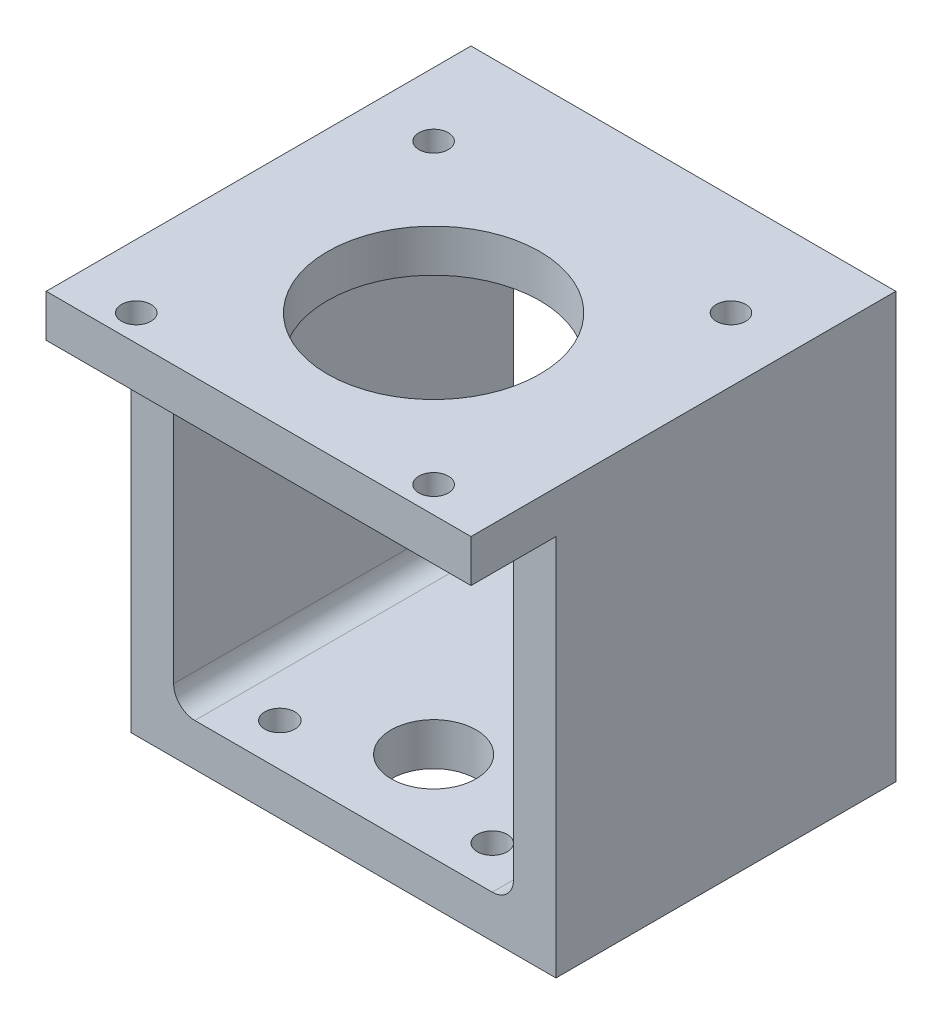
ISO-10303-21;
HEADER;
FILE_DESCRIPTION(('STEP AP214'),'2;1');
FILE_NAME('part.step','',(''),(''),'','','');
FILE_SCHEMA(('AUTOMOTIVE_DESIGN { 1 0 10303 214 1 1 1 1 }'));
ENDSEC;
DATA;
#1=APPLICATION_CONTEXT('core data for automotive mechanical design processes');
#2=APPLICATION_PROTOCOL_DEFINITION('international standard','automotive_design',2000,#1);
#3=PRODUCT_CONTEXT('',#1,'mechanical');
#4=PRODUCT('Part','Part','',(#3));
#5=PRODUCT_RELATED_PRODUCT_CATEGORY('part','',(#4));
#6=PRODUCT_DEFINITION_FORMATION('','',#4);
#7=PRODUCT_DEFINITION_CONTEXT('part definition',#1,'design');
#8=PRODUCT_DEFINITION('design','',#6,#7);
#9=PRODUCT_DEFINITION_SHAPE('','',#8);
#10=(LENGTH_UNIT() NAMED_UNIT(*) SI_UNIT(.MILLI.,.METRE.));
#11=(NAMED_UNIT(*) PLANE_ANGLE_UNIT() SI_UNIT($,.RADIAN.));
#12=(NAMED_UNIT(*) SI_UNIT($,.STERADIAN.) SOLID_ANGLE_UNIT());
#13=UNCERTAINTY_MEASURE_WITH_UNIT(LENGTH_MEASURE(1.E-05),#10,'distance_accuracy_value','');
#14=(GEOMETRIC_REPRESENTATION_CONTEXT(3) GLOBAL_UNCERTAINTY_ASSIGNED_CONTEXT((#13)) GLOBAL_UNIT_ASSIGNED_CONTEXT((#10,
#11,#12)) REPRESENTATION_CONTEXT('',''));
#15=CARTESIAN_POINT('',(0.,0.,0.));
#16=DIRECTION('',(0.,0.,1.));
#17=DIRECTION('',(1.,0.,0.));
#18=AXIS2_PLACEMENT_3D('',#15,#16,#17);
#19=CARTESIAN_POINT('',(0.,0.,-63.5));
#20=DIRECTION('',(-1.,0.,0.));
#21=DIRECTION('',(0.,0.,1.));
#22=AXIS2_PLACEMENT_3D('',#19,#20,#21);
#23=PLANE('',#22);
#24=DIRECTION('',(0.,0.,1.));
#25=VECTOR('',#24,1.);
#26=CARTESIAN_POINT('',(0.,57.15,0.));
#27=LINE('',#26,#25);
#28=CARTESIAN_POINT('',(0.,57.15,-12.7));
#29=VERTEX_POINT('',#28);
#30=CARTESIAN_POINT('',(0.,57.15,0.));
#31=VERTEX_POINT('',#30);
#32=EDGE_CURVE('E237',#29,#31,#27,.T.);
#33=ORIENTED_EDGE('',*,*,#32,.T.);
#34=DIRECTION('',(0.,-1.,0.));
#35=VECTOR('',#34,1.);
#36=CARTESIAN_POINT('',(0.,0.,0.));
#37=LINE('',#36,#35);
#38=CARTESIAN_POINT('',(0.,63.5,0.));
#39=VERTEX_POINT('',#38);
#40=EDGE_CURVE('E299',#39,#31,#37,.T.);
#41=ORIENTED_EDGE('',*,*,#40,.F.);
#42=DIRECTION('',(0.,0.,1.));
#43=VECTOR('',#42,1.);
#44=CARTESIAN_POINT('',(0.,63.5,-63.5));
#45=LINE('',#44,#43);
#46=CARTESIAN_POINT('',(0.,63.5,-63.5));
#47=VERTEX_POINT('',#46);
#48=EDGE_CURVE('E342',#47,#39,#45,.T.);
#49=ORIENTED_EDGE('',*,*,#48,.F.);
#50=DIRECTION('',(0.,-1.,0.));
#51=VECTOR('',#50,1.);
#52=CARTESIAN_POINT('',(0.,0.,-63.5));
#53=LINE('',#52,#51);
#54=CARTESIAN_POINT('',(0.,0.,-63.5));
#55=VERTEX_POINT('',#54);
#56=EDGE_CURVE('E322',#47,#55,#53,.T.);
#57=ORIENTED_EDGE('',*,*,#56,.T.);
#58=DIRECTION('',(0.,0.,1.));
#59=VECTOR('',#58,1.);
#60=CARTESIAN_POINT('',(0.,0.,-63.5));
#61=LINE('',#60,#59);
#62=CARTESIAN_POINT('',(0.,0.,-12.7));
#63=VERTEX_POINT('',#62);
#64=EDGE_CURVE('E335',#55,#63,#61,.T.);
#65=ORIENTED_EDGE('',*,*,#64,.T.);
#66=DIRECTION('',(0.,1.,0.));
#67=VECTOR('',#66,1.);
#68=CARTESIAN_POINT('',(0.,0.,-12.7));
#69=LINE('',#68,#67);
#70=EDGE_CURVE('E234',#63,#29,#69,.T.);
#71=ORIENTED_EDGE('',*,*,#70,.T.);
#72=EDGE_LOOP('',(#33,#41,#49,#57,#65,#71));
#73=FACE_BOUND('',#72,.T.);
#74=ADVANCED_FACE('F34',(#73),#23,.T.);
#75=CARTESIAN_POINT('',(0.,63.5,-63.5));
#76=DIRECTION('',(0.,1.,0.));
#77=DIRECTION('',(0.,0.,1.));
#78=AXIS2_PLACEMENT_3D('',#75,#76,#77);
#79=PLANE('',#78);
#80=CARTESIAN_POINT('',(9.52499999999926,63.5,-48.387));
#81=DIRECTION('',(0.,1.,0.));
#82=DIRECTION('',(0.,0.,1.));
#83=AXIS2_PLACEMENT_3D('',#80,#81,#82);
#84=CIRCLE('',#83,2.1971);
#85=CARTESIAN_POINT('',(9.52499999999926,63.5,-46.1899));
#86=VERTEX_POINT('',#85);
#87=EDGE_CURVE('E205',#86,#86,#84,.T.);
#88=ORIENTED_EDGE('',*,*,#87,.F.);
#89=EDGE_LOOP('',(#88));
#90=FACE_BOUND('',#89,.T.);
#91=CARTESIAN_POINT('',(9.52499999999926,63.5,-3.93700000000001));
#92=DIRECTION('',(0.,1.,0.));
#93=DIRECTION('',(0.,0.,1.));
#94=AXIS2_PLACEMENT_3D('',#91,#92,#93);
#95=CIRCLE('',#94,2.1971);
#96=CARTESIAN_POINT('',(9.52499999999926,63.5,-1.73990000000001));
#97=VERTEX_POINT('',#96);
#98=EDGE_CURVE('E209',#97,#97,#95,.T.);
#99=ORIENTED_EDGE('',*,*,#98,.F.);
#100=EDGE_LOOP('',(#99));
#101=FACE_BOUND('',#100,.T.);
#102=CARTESIAN_POINT('',(53.9749999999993,63.5,-48.387));
#103=DIRECTION('',(0.,1.,0.));
#104=DIRECTION('',(0.,0.,1.));
#105=AXIS2_PLACEMENT_3D('',#102,#103,#104);
#106=CIRCLE('',#105,2.1971);
#107=CARTESIAN_POINT('',(53.9749999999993,63.5,-46.1899));
#108=VERTEX_POINT('',#107);
#109=EDGE_CURVE('E213',#108,#108,#106,.T.);
#110=ORIENTED_EDGE('',*,*,#109,.F.);
#111=EDGE_LOOP('',(#110));
#112=FACE_BOUND('',#111,.T.);
#113=CARTESIAN_POINT('',(53.9749999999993,63.5,-3.937));
#114=DIRECTION('',(0.,1.,0.));
#115=DIRECTION('',(0.,0.,1.));
#116=AXIS2_PLACEMENT_3D('',#113,#114,#115);
#117=CIRCLE('',#116,2.1971);
#118=CARTESIAN_POINT('',(53.9749999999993,63.5,-1.7399));
#119=VERTEX_POINT('',#118);
#120=EDGE_CURVE('E217',#119,#119,#117,.T.);
#121=ORIENTED_EDGE('',*,*,#120,.F.);
#122=EDGE_LOOP('',(#121));
#123=FACE_BOUND('',#122,.T.);
#124=CARTESIAN_POINT('',(31.7499999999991,63.5,-26.162));
#125=DIRECTION('',(0.,1.,0.));
#126=DIRECTION('',(0.,0.,1.));
#127=AXIS2_PLACEMENT_3D('',#124,#125,#126);
#128=CIRCLE('',#127,15.875);
#129=CARTESIAN_POINT('',(31.7499999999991,63.5,-10.287));
#130=VERTEX_POINT('',#129);
#131=EDGE_CURVE('E227',#130,#130,#128,.T.);
#132=ORIENTED_EDGE('',*,*,#131,.F.);
#133=EDGE_LOOP('',(#132));
#134=FACE_BOUND('',#133,.T.);
#135=DIRECTION('',(-1.,0.,0.));
#136=VECTOR('',#135,1.);
#137=CARTESIAN_POINT('',(0.,63.5,0.));
#138=LINE('',#137,#136);
#139=CARTESIAN_POINT('',(63.5,63.5,0.));
#140=VERTEX_POINT('',#139);
#141=EDGE_CURVE('E326',#140,#39,#138,.T.);
#142=ORIENTED_EDGE('',*,*,#141,.F.);
#143=DIRECTION('',(0.,0.,1.));
#144=VECTOR('',#143,1.);
#145=CARTESIAN_POINT('',(63.5,63.5,-63.5));
#146=LINE('',#145,#144);
#147=CARTESIAN_POINT('',(63.5,63.5,-63.5));
#148=VERTEX_POINT('',#147);
#149=EDGE_CURVE('E345',#148,#140,#146,.T.);
#150=ORIENTED_EDGE('',*,*,#149,.F.);
#151=DIRECTION('',(-1.,0.,0.));
#152=VECTOR('',#151,1.);
#153=CARTESIAN_POINT('',(0.,63.5,-63.5));
#154=LINE('',#153,#152);
#155=EDGE_CURVE('E332',#148,#47,#154,.T.);
#156=ORIENTED_EDGE('',*,*,#155,.T.);
#157=ORIENTED_EDGE('',*,*,#48,.T.);
#158=EDGE_LOOP('',(#142,#150,#156,#157));
#159=FACE_BOUND('',#158,.T.);
#160=ADVANCED_FACE('F407',(#90,#101,#112,#123,#134,#159),#79,.T.);
#161=CARTESIAN_POINT('',(63.5,0.,-63.5));
#162=DIRECTION('',(1.,0.,0.));
#163=DIRECTION('',(0.,0.,-1.));
#164=AXIS2_PLACEMENT_3D('',#161,#162,#163);
#165=PLANE('',#164);
#166=DIRECTION('',(0.,0.,1.));
#167=VECTOR('',#166,1.);
#168=CARTESIAN_POINT('',(63.5,57.15,0.));
#169=LINE('',#168,#167);
#170=CARTESIAN_POINT('',(63.5,57.15,-12.7));
#171=VERTEX_POINT('',#170);
#172=CARTESIAN_POINT('',(63.5,57.15,0.));
#173=VERTEX_POINT('',#172);
#174=EDGE_CURVE('E238',#171,#173,#169,.T.);
#175=ORIENTED_EDGE('',*,*,#174,.F.);
#176=DIRECTION('',(0.,1.,0.));
#177=VECTOR('',#176,1.);
#178=CARTESIAN_POINT('',(63.5,0.,-12.7));
#179=LINE('',#178,#177);
#180=CARTESIAN_POINT('',(63.5,0.,-12.7));
#181=VERTEX_POINT('',#180);
#182=EDGE_CURVE('E233',#181,#171,#179,.T.);
#183=ORIENTED_EDGE('',*,*,#182,.F.);
#184=DIRECTION('',(0.,0.,1.));
#185=VECTOR('',#184,1.);
#186=CARTESIAN_POINT('',(63.5,0.,-63.5));
#187=LINE('',#186,#185);
#188=CARTESIAN_POINT('',(63.5,0.,-63.5));
#189=VERTEX_POINT('',#188);
#190=EDGE_CURVE('E348',#189,#181,#187,.T.);
#191=ORIENTED_EDGE('',*,*,#190,.F.);
#192=DIRECTION('',(0.,1.,0.));
#193=VECTOR('',#192,1.);
#194=CARTESIAN_POINT('',(63.5,0.,-63.5));
#195=LINE('',#194,#193);
#196=EDGE_CURVE('E329',#189,#148,#195,.T.);
#197=ORIENTED_EDGE('',*,*,#196,.T.);
#198=ORIENTED_EDGE('',*,*,#149,.T.);
#199=DIRECTION('',(0.,1.,0.));
#200=VECTOR('',#199,1.);
#201=CARTESIAN_POINT('',(63.5,0.,0.));
#202=LINE('',#201,#200);
#203=EDGE_CURVE('E338',#173,#140,#202,.T.);
#204=ORIENTED_EDGE('',*,*,#203,.F.);
#205=EDGE_LOOP('',(#175,#183,#191,#197,#198,#204));
#206=FACE_BOUND('',#205,.T.);
#207=ADVANCED_FACE('F412',(#206),#165,.T.);
#208=CARTESIAN_POINT('',(0.,0.,-63.5));
#209=DIRECTION('',(0.,-1.,0.));
#210=DIRECTION('',(0.,0.,-1.));
#211=AXIS2_PLACEMENT_3D('',#208,#209,#210);
#212=PLANE('',#211);
#213=CARTESIAN_POINT('',(15.875,0.,-19.05));
#214=DIRECTION('',(0.,-1.,0.));
#215=DIRECTION('',(0.,0.,-1.));
#216=AXIS2_PLACEMENT_3D('',#213,#214,#215);
#217=CIRCLE('',#216,2.24789999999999);
#218=CARTESIAN_POINT('',(15.875,0.,-21.2979));
#219=VERTEX_POINT('',#218);
#220=EDGE_CURVE('E190',#219,#219,#217,.T.);
#221=ORIENTED_EDGE('',*,*,#220,.F.);
#222=EDGE_LOOP('',(#221));
#223=FACE_BOUND('',#222,.T.);
#224=CARTESIAN_POINT('',(15.875,0.,-57.15));
#225=DIRECTION('',(0.,-1.,0.));
#226=DIRECTION('',(0.,0.,-1.));
#227=AXIS2_PLACEMENT_3D('',#224,#225,#226);
#228=CIRCLE('',#227,2.24789999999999);
#229=CARTESIAN_POINT('',(15.875,0.,-59.3979));
#230=VERTEX_POINT('',#229);
#231=EDGE_CURVE('E193',#230,#230,#228,.T.);
#232=ORIENTED_EDGE('',*,*,#231,.F.);
#233=EDGE_LOOP('',(#232));
#234=FACE_BOUND('',#233,.T.);
#235=CARTESIAN_POINT('',(47.625,0.,-57.15));
#236=DIRECTION('',(0.,-1.,0.));
#237=DIRECTION('',(0.,0.,-1.));
#238=AXIS2_PLACEMENT_3D('',#235,#236,#237);
#239=CIRCLE('',#238,2.24789999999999);
#240=CARTESIAN_POINT('',(47.625,0.,-59.3979));
#241=VERTEX_POINT('',#240);
#242=EDGE_CURVE('E197',#241,#241,#239,.T.);
#243=ORIENTED_EDGE('',*,*,#242,.F.);
#244=EDGE_LOOP('',(#243));
#245=FACE_BOUND('',#244,.T.);
#246=CARTESIAN_POINT('',(47.625,0.,-19.05));
#247=DIRECTION('',(0.,-1.,0.));
#248=DIRECTION('',(0.,0.,-1.));
#249=AXIS2_PLACEMENT_3D('',#246,#247,#248);
#250=CIRCLE('',#249,2.24789999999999);
#251=CARTESIAN_POINT('',(47.625,0.,-21.2979));
#252=VERTEX_POINT('',#251);
#253=EDGE_CURVE('E201',#252,#252,#250,.T.);
#254=ORIENTED_EDGE('',*,*,#253,.F.);
#255=EDGE_LOOP('',(#254));
#256=FACE_BOUND('',#255,.T.);
#257=CARTESIAN_POINT('',(31.7499999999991,0.,-26.162));
#258=DIRECTION('',(0.,-1.,0.));
#259=DIRECTION('',(0.,0.,-1.));
#260=AXIS2_PLACEMENT_3D('',#257,#258,#259);
#261=CIRCLE('',#260,6.35);
#262=CARTESIAN_POINT('',(31.7499999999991,0.,-32.512));
#263=VERTEX_POINT('',#262);
#264=EDGE_CURVE('E224',#263,#263,#261,.F.);
#265=ORIENTED_EDGE('',*,*,#264,.T.);
#266=EDGE_LOOP('',(#265));
#267=FACE_BOUND('',#266,.T.);
#268=DIRECTION('',(1.,0.,0.));
#269=VECTOR('',#268,1.);
#270=CARTESIAN_POINT('',(0.,0.,-12.7));
#271=LINE('',#270,#269);
#272=EDGE_CURVE('E241',#63,#181,#271,.T.);
#273=ORIENTED_EDGE('',*,*,#272,.F.);
#274=ORIENTED_EDGE('',*,*,#64,.F.);
#275=DIRECTION('',(1.,0.,0.));
#276=VECTOR('',#275,1.);
#277=CARTESIAN_POINT('',(0.,0.,-63.5));
#278=LINE('',#277,#276);
#279=EDGE_CURVE('E325',#55,#189,#278,.T.);
#280=ORIENTED_EDGE('',*,*,#279,.T.);
#281=ORIENTED_EDGE('',*,*,#190,.T.);
#282=EDGE_LOOP('',(#273,#274,#280,#281));
#283=FACE_BOUND('',#282,.T.);
#284=ADVANCED_FACE('F430',(#223,#234,#245,#256,#267,#283),#212,.T.);
#285=CARTESIAN_POINT('',(0.,63.5,-63.5));
#286=DIRECTION('',(0.,0.,-1.));
#287=DIRECTION('',(-1.,0.,0.));
#288=AXIS2_PLACEMENT_3D('',#285,#286,#287);
#289=PLANE('',#288);
#290=CARTESIAN_POINT('',(60.325,60.325,-63.5));
#291=DIRECTION('',(0.,0.,-1.));
#292=DIRECTION('',(-1.,0.,0.));
#293=AXIS2_PLACEMENT_3D('',#290,#291,#292);
#294=CIRCLE('',#293,1.52399999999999);
#295=CARTESIAN_POINT('',(58.801,60.325,-63.5));
#296=VERTEX_POINT('',#295);
#297=EDGE_CURVE('E168',#296,#296,#294,.T.);
#298=ORIENTED_EDGE('',*,*,#297,.F.);
#299=EDGE_LOOP('',(#298));
#300=FACE_BOUND('',#299,.T.);
#301=CARTESIAN_POINT('',(3.175,60.325,-63.5));
#302=DIRECTION('',(0.,0.,-1.));
#303=DIRECTION('',(-1.,0.,0.));
#304=AXIS2_PLACEMENT_3D('',#301,#302,#303);
#305=CIRCLE('',#304,1.52399999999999);
#306=CARTESIAN_POINT('',(1.65100000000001,60.325,-63.5));
#307=VERTEX_POINT('',#306);
#308=EDGE_CURVE('E167',#307,#307,#305,.T.);
#309=ORIENTED_EDGE('',*,*,#308,.F.);
#310=EDGE_LOOP('',(#309));
#311=FACE_BOUND('',#310,.T.);
#312=CARTESIAN_POINT('',(3.175,3.175,-63.5));
#313=DIRECTION('',(0.,0.,-1.));
#314=DIRECTION('',(-1.,0.,0.));
#315=AXIS2_PLACEMENT_3D('',#312,#313,#314);
#316=CIRCLE('',#315,1.52399999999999);
#317=CARTESIAN_POINT('',(1.65100000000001,3.175,-63.5));
#318=VERTEX_POINT('',#317);
#319=EDGE_CURVE('E178',#318,#318,#316,.T.);
#320=ORIENTED_EDGE('',*,*,#319,.F.);
#321=EDGE_LOOP('',(#320));
#322=FACE_BOUND('',#321,.T.);
#323=CARTESIAN_POINT('',(60.325,3.17500000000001,-63.5));
#324=DIRECTION('',(0.,0.,-1.));
#325=DIRECTION('',(-1.,0.,0.));
#326=AXIS2_PLACEMENT_3D('',#323,#324,#325);
#327=CIRCLE('',#326,1.52399999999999);
#328=CARTESIAN_POINT('',(58.801,3.17500000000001,-63.5));
#329=VERTEX_POINT('',#328);
#330=EDGE_CURVE('E184',#329,#329,#327,.T.);
#331=ORIENTED_EDGE('',*,*,#330,.F.);
#332=EDGE_LOOP('',(#331));
#333=FACE_BOUND('',#332,.T.);
#334=CARTESIAN_POINT('',(9.525,53.975,-63.5));
#335=DIRECTION('',(0.,0.,1.));
#336=DIRECTION('',(1.,0.,0.));
#337=AXIS2_PLACEMENT_3D('',#334,#335,#336);
#338=CIRCLE('',#337,3.175);
#339=CARTESIAN_POINT('',(9.525,57.15,-63.5));
#340=VERTEX_POINT('',#339);
#341=CARTESIAN_POINT('',(6.35,53.975,-63.5));
#342=VERTEX_POINT('',#341);
#343=EDGE_CURVE('E270',#340,#342,#338,.T.);
#344=ORIENTED_EDGE('',*,*,#343,.T.);
#345=DIRECTION('',(0.,-1.,0.));
#346=VECTOR('',#345,1.);
#347=CARTESIAN_POINT('',(6.35,53.975,-63.5));
#348=LINE('',#347,#346);
#349=CARTESIAN_POINT('',(6.35,9.52500000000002,-63.5));
#350=VERTEX_POINT('',#349);
#351=EDGE_CURVE('E273',#342,#350,#348,.T.);
#352=ORIENTED_EDGE('',*,*,#351,.T.);
#353=CARTESIAN_POINT('',(9.525,9.525,-63.5));
#354=DIRECTION('',(0.,0.,1.));
#355=DIRECTION('',(1.,0.,0.));
#356=AXIS2_PLACEMENT_3D('',#353,#354,#355);
#357=CIRCLE('',#356,3.175);
#358=CARTESIAN_POINT('',(9.52500000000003,6.35,-63.5));
#359=VERTEX_POINT('',#358);
#360=EDGE_CURVE('E276',#350,#359,#357,.T.);
#361=ORIENTED_EDGE('',*,*,#360,.T.);
#362=DIRECTION('',(1.,0.,0.));
#363=VECTOR('',#362,1.);
#364=CARTESIAN_POINT('',(9.52500000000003,6.35,-63.5));
#365=LINE('',#364,#363);
#366=CARTESIAN_POINT('',(53.975,6.35,-63.5));
#367=VERTEX_POINT('',#366);
#368=EDGE_CURVE('E279',#359,#367,#365,.T.);
#369=ORIENTED_EDGE('',*,*,#368,.T.);
#370=CARTESIAN_POINT('',(53.975,9.525,-63.5));
#371=DIRECTION('',(0.,0.,1.));
#372=DIRECTION('',(1.,0.,0.));
#373=AXIS2_PLACEMENT_3D('',#370,#371,#372);
#374=CIRCLE('',#373,3.175);
#375=CARTESIAN_POINT('',(57.15,9.525,-63.5));
#376=VERTEX_POINT('',#375);
#377=EDGE_CURVE('E282',#367,#376,#374,.T.);
#378=ORIENTED_EDGE('',*,*,#377,.T.);
#379=DIRECTION('',(0.,1.,0.));
#380=VECTOR('',#379,1.);
#381=CARTESIAN_POINT('',(57.15,53.975,-63.5));
#382=LINE('',#381,#380);
#383=CARTESIAN_POINT('',(57.15,53.975,-63.5));
#384=VERTEX_POINT('',#383);
#385=EDGE_CURVE('E285',#376,#384,#382,.T.);
#386=ORIENTED_EDGE('',*,*,#385,.T.);
#387=CARTESIAN_POINT('',(53.975,53.975,-63.5));
#388=DIRECTION('',(0.,0.,1.));
#389=DIRECTION('',(-1.,0.,0.));
#390=AXIS2_PLACEMENT_3D('',#387,#388,#389);
#391=CIRCLE('',#390,3.175);
#392=CARTESIAN_POINT('',(53.975,57.15,-63.5));
#393=VERTEX_POINT('',#392);
#394=EDGE_CURVE('E288',#384,#393,#391,.T.);
#395=ORIENTED_EDGE('',*,*,#394,.T.);
#396=DIRECTION('',(-1.,0.,0.));
#397=VECTOR('',#396,1.);
#398=CARTESIAN_POINT('',(9.525,57.15,-63.5));
#399=LINE('',#398,#397);
#400=EDGE_CURVE('E291',#393,#340,#399,.T.);
#401=ORIENTED_EDGE('',*,*,#400,.T.);
#402=EDGE_LOOP('',(#344,#352,#361,#369,#378,#386,#395,#401));
#403=FACE_BOUND('',#402,.T.);
#404=ORIENTED_EDGE('',*,*,#56,.F.);
#405=ORIENTED_EDGE('',*,*,#155,.F.);
#406=ORIENTED_EDGE('',*,*,#196,.F.);
#407=ORIENTED_EDGE('',*,*,#279,.F.);
#408=EDGE_LOOP('',(#404,#405,#406,#407));
#409=FACE_BOUND('',#408,.T.);
#410=ADVANCED_FACE('F426',(#300,#311,#322,#333,#403,#409),#289,.T.);
#411=CARTESIAN_POINT('',(0.,63.5,0.));
#412=DIRECTION('',(0.,0.,-1.));
#413=DIRECTION('',(-1.,0.,0.));
#414=AXIS2_PLACEMENT_3D('',#411,#412,#413);
#415=PLANE('',#414);
#416=ORIENTED_EDGE('',*,*,#40,.T.);
#417=DIRECTION('',(-1.,0.,0.));
#418=VECTOR('',#417,1.);
#419=CARTESIAN_POINT('',(9.525,57.15,0.));
#420=LINE('',#419,#418);
#421=EDGE_CURVE('E269',#173,#31,#420,.T.);
#422=ORIENTED_EDGE('',*,*,#421,.F.);
#423=ORIENTED_EDGE('',*,*,#203,.T.);
#424=ORIENTED_EDGE('',*,*,#141,.T.);
#425=EDGE_LOOP('',(#416,#422,#423,#424));
#426=FACE_BOUND('',#425,.T.);
#427=ADVANCED_FACE('F401',(#426),#415,.F.);
#428=CARTESIAN_POINT('',(9.525,53.975,-63.5));
#429=DIRECTION('',(0.,0.,1.));
#430=DIRECTION('',(1.,0.,0.));
#431=AXIS2_PLACEMENT_3D('',#428,#429,#430);
#432=CYLINDRICAL_SURFACE('',#431,3.175);
#433=DIRECTION('',(0.,0.,1.));
#434=VECTOR('',#433,1.);
#435=CARTESIAN_POINT('',(9.525,57.15,-63.5));
#436=LINE('',#435,#434);
#437=CARTESIAN_POINT('',(9.525,57.15,-50.5841));
#438=VERTEX_POINT('',#437);
#439=EDGE_CURVE('E296',#340,#438,#436,.T.);
#440=ORIENTED_EDGE('',*,*,#439,.T.);
#441=CARTESIAN_POINT('',(9.525,57.15,-50.5841));
#442=CARTESIAN_POINT('',(9.47002958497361,57.1500119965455,-50.5841110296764));
#443=CARTESIAN_POINT('',(9.41506752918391,57.1485727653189,-50.5820373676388));
#444=CARTESIAN_POINT('',(9.30562816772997,57.1428828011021,-50.5738061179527));
#445=CARTESIAN_POINT('',(9.25115059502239,57.1386337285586,-50.5676509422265));
#446=CARTESIAN_POINT('',(9.14342311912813,57.127450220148,-50.5513933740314));
#447=CARTESIAN_POINT('',(9.09016763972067,57.1205328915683,-50.5413161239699));
#448=CARTESIAN_POINT('',(8.98492079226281,57.1041820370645,-50.5173706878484));
#449=CARTESIAN_POINT('',(8.93292955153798,57.0947482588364,-50.5035021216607));
#450=CARTESIAN_POINT('',(8.77958333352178,57.0630129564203,-50.4565383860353));
#451=CARTESIAN_POINT('',(8.68053740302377,57.0372426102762,-50.4180357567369));
#452=CARTESIAN_POINT('',(8.49071449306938,56.978464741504,-50.328280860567));
#453=CARTESIAN_POINT('',(8.39994866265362,56.9454476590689,-50.2770117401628));
#454=CARTESIAN_POINT('',(8.22038064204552,56.8713456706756,-50.158377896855));
#455=CARTESIAN_POINT('',(8.13243593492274,56.8298088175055,-50.0900010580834));
#456=CARTESIAN_POINT('',(7.96848419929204,56.7438401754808,-49.9415933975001));
#457=CARTESIAN_POINT('',(7.89249353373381,56.6994045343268,-49.8615468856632));
#458=CARTESIAN_POINT('',(7.74120752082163,56.603313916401,-49.676193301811));
#459=CARTESIAN_POINT('',(7.66827295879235,56.5517297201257,-49.5689089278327));
#460=CARTESIAN_POINT('',(7.54146115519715,56.4554293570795,-49.3408232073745));
#461=CARTESIAN_POINT('',(7.4875513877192,56.4107015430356,-49.2200454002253));
#462=CARTESIAN_POINT('',(7.41470036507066,56.3475176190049,-49.0054587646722));
#463=CARTESIAN_POINT('',(7.39010623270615,56.3252107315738,-48.9147163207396));
#464=CARTESIAN_POINT('',(7.35263352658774,56.2906235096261,-48.7290554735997));
#465=CARTESIAN_POINT('',(7.3397328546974,56.2783242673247,-48.6341453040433));
#466=CARTESIAN_POINT('',(7.32647484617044,56.2656789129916,-48.4421109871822));
#467=CARTESIAN_POINT('',(7.32618404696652,56.2653962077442,-48.3449778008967));
#468=CARTESIAN_POINT('',(7.33834245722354,56.2770020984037,-48.1522264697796));
#469=CARTESIAN_POINT('',(7.35080067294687,56.2888992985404,-48.0566094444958));
#470=CARTESIAN_POINT('',(7.38643407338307,56.3218475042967,-47.8753216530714));
#471=CARTESIAN_POINT('',(7.40891656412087,56.3423022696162,-47.7893989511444));
#472=CARTESIAN_POINT('',(7.46331352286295,56.3898247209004,-47.6225319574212));
#473=CARTESIAN_POINT('',(7.49523535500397,56.4168975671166,-47.5415916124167));
#474=CARTESIAN_POINT('',(7.58625372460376,56.4903166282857,-47.3451134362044));
#475=CARTESIAN_POINT('',(7.6508867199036,56.539420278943,-47.2331569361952));
#476=CARTESIAN_POINT('',(7.79786244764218,56.6406363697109,-47.0229101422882));
#477=CARTESIAN_POINT('',(7.88024008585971,56.6927545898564,-46.9246474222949));
#478=CARTESIAN_POINT('',(8.06251100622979,56.7950703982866,-46.7422640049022));
#479=CARTESIAN_POINT('',(8.16257743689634,56.8452423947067,-46.6583009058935));
#480=CARTESIAN_POINT('',(8.37833400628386,56.9380221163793,-46.5082805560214));
#481=CARTESIAN_POINT('',(8.49399390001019,56.9806441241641,-46.4421893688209));
#482=CARTESIAN_POINT('',(8.71146617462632,57.0456173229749,-46.3433848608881));
#483=CARTESIAN_POINT('',(8.81068306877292,57.0703669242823,-46.3065222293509));
#484=CARTESIAN_POINT('',(9.01507976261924,57.1105032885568,-46.2472600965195));
#485=CARTESIAN_POINT('',(9.12024684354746,57.125909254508,-46.2248309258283));
#486=CARTESIAN_POINT('',(9.27613822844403,57.140621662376,-46.2034700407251));
#487=CARTESIAN_POINT('',(9.3257100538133,57.1441304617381,-46.1983887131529));
#488=CARTESIAN_POINT('',(9.42517901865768,57.1488209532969,-46.1916032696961));
#489=CARTESIAN_POINT('',(9.47507606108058,57.1500033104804,-46.1898981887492));
#490=CARTESIAN_POINT('',(9.52499999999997,57.1500000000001,-46.1898999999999));
#491=B_SPLINE_CURVE_WITH_KNOTS('',3,(#441,#442,#443,#444,#445,#446,#447,#448,#449,#450,#451,
#452,#453,#454,#455,#456,#457,#458,#459,#460,#461,#462,#463,#464,#465,#466,#467,#468,#469,#470,
#471,#472,#473,#474,#475,#476,#477,#478,#479,#480,#481,#482,#483,#484,#485,#486,#487,#488,#489,
#490),.UNSPECIFIED.,.F.,.F.,(4,2,2,2,2,2,2,2,2,2,2,2,2,2,2,2,2,2,2,2,2,2,2,2,4),(0.,
0.164839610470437,0.329581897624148,0.493285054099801,0.657004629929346,0.983483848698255,
1.31039637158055,1.66574365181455,2.02157318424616,2.43851361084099,2.85473771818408,
3.14351093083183,3.43173727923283,3.72148430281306,4.0114361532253,4.28387634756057,
4.55652965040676,4.96921631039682,5.3827223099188,5.80052604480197,6.21753076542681,
6.54230093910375,6.86640136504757,7.0161207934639,7.16579742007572),.UNSPECIFIED.);
#492=CARTESIAN_POINT('',(9.525,57.15,-46.1899));
#493=VERTEX_POINT('',#492);
#494=EDGE_CURVE('E11',#438,#493,#491,.T.);
#495=ORIENTED_EDGE('',*,*,#494,.T.);
#496=CARTESIAN_POINT('',(9.525,57.15,-12.7));
#497=VERTEX_POINT('',#496);
#498=EDGE_CURVE('E300',#493,#497,#436,.T.);
#499=ORIENTED_EDGE('',*,*,#498,.T.);
#500=CARTESIAN_POINT('',(9.525,53.975,-12.7));
#501=DIRECTION('',(0.,0.,-1.));
#502=DIRECTION('',(-1.,0.,0.));
#503=AXIS2_PLACEMENT_3D('',#500,#501,#502);
#504=CIRCLE('',#503,3.175);
#505=CARTESIAN_POINT('',(6.35,53.975,-12.7));
#506=VERTEX_POINT('',#505);
#507=EDGE_CURVE('E266',#497,#506,#504,.F.);
#508=ORIENTED_EDGE('',*,*,#507,.T.);
#509=DIRECTION('',(0.,0.,1.));
#510=VECTOR('',#509,1.);
#511=CARTESIAN_POINT('',(6.35,53.975,-63.5));
#512=LINE('',#511,#510);
#513=EDGE_CURVE('E294',#342,#506,#512,.T.);
#514=ORIENTED_EDGE('',*,*,#513,.F.);
#515=ORIENTED_EDGE('',*,*,#343,.F.);
#516=EDGE_LOOP('',(#440,#495,#499,#508,#514,#515));
#517=FACE_BOUND('',#516,.T.);
#518=ADVANCED_FACE('F393',(#517),#432,.F.);
#519=CARTESIAN_POINT('',(9.525,57.15,-63.5));
#520=DIRECTION('',(0.,1.,0.));
#521=DIRECTION('',(0.,0.,1.));
#522=AXIS2_PLACEMENT_3D('',#519,#520,#521);
#523=PLANE('',#522);
#524=CARTESIAN_POINT('',(9.52499999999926,57.15,-3.93700000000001));
#525=DIRECTION('',(0.,1.,0.));
#526=DIRECTION('',(0.,0.,1.));
#527=AXIS2_PLACEMENT_3D('',#524,#525,#526);
#528=CIRCLE('',#527,2.1971);
#529=CARTESIAN_POINT('',(9.52499999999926,57.15,-1.73990000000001));
#530=VERTEX_POINT('',#529);
#531=EDGE_CURVE('E212',#530,#530,#528,.T.);
#532=ORIENTED_EDGE('',*,*,#531,.T.);
#533=EDGE_LOOP('',(#532));
#534=FACE_BOUND('',#533,.T.);
#535=CARTESIAN_POINT('',(53.9749999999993,57.15,-3.937));
#536=DIRECTION('',(0.,1.,0.));
#537=DIRECTION('',(0.,0.,1.));
#538=AXIS2_PLACEMENT_3D('',#535,#536,#537);
#539=CIRCLE('',#538,2.1971);
#540=CARTESIAN_POINT('',(53.9749999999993,57.15,-1.7399));
#541=VERTEX_POINT('',#540);
#542=EDGE_CURVE('E220',#541,#541,#539,.T.);
#543=ORIENTED_EDGE('',*,*,#542,.T.);
#544=EDGE_LOOP('',(#543));
#545=FACE_BOUND('',#544,.T.);
#546=CARTESIAN_POINT('',(31.7499999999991,57.15,-26.162));
#547=DIRECTION('',(0.,1.,0.));
#548=DIRECTION('',(0.,0.,1.));
#549=AXIS2_PLACEMENT_3D('',#546,#547,#548);
#550=CIRCLE('',#549,15.875);
#551=CARTESIAN_POINT('',(31.7499999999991,57.15,-10.287));
#552=VERTEX_POINT('',#551);
#553=EDGE_CURVE('E230',#552,#552,#550,.F.);
#554=ORIENTED_EDGE('',*,*,#553,.F.);
#555=EDGE_LOOP('',(#554));
#556=FACE_BOUND('',#555,.T.);
#557=ORIENTED_EDGE('',*,*,#498,.F.);
#558=CARTESIAN_POINT('',(9.52499999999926,57.15,-48.387));
#559=DIRECTION('',(0.,1.,0.));
#560=DIRECTION('',(0.,0.,1.));
#561=AXIS2_PLACEMENT_3D('',#558,#559,#560);
#562=CIRCLE('',#561,2.1971);
#563=EDGE_CURVE('E49',#493,#438,#562,.T.);
#564=ORIENTED_EDGE('',*,*,#563,.T.);
#565=ORIENTED_EDGE('',*,*,#439,.F.);
#566=ORIENTED_EDGE('',*,*,#400,.F.);
#567=DIRECTION('',(0.,0.,1.));
#568=VECTOR('',#567,1.);
#569=CARTESIAN_POINT('',(53.975,57.15,-63.5));
#570=LINE('',#569,#568);
#571=CARTESIAN_POINT('',(53.975,57.15,-50.5841));
#572=VERTEX_POINT('',#571);
#573=EDGE_CURVE('E301',#393,#572,#570,.T.);
#574=ORIENTED_EDGE('',*,*,#573,.T.);
#575=CARTESIAN_POINT('',(53.9749999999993,57.15,-48.387));
#576=DIRECTION('',(0.,1.,0.));
#577=DIRECTION('',(0.,0.,1.));
#578=AXIS2_PLACEMENT_3D('',#575,#576,#577);
#579=CIRCLE('',#578,2.1971);
#580=CARTESIAN_POINT('',(53.975,57.15,-46.1899));
#581=VERTEX_POINT('',#580);
#582=EDGE_CURVE('E55',#572,#581,#579,.T.);
#583=ORIENTED_EDGE('',*,*,#582,.T.);
#584=CARTESIAN_POINT('',(53.975,57.15,-12.7));
#585=VERTEX_POINT('',#584);
#586=EDGE_CURVE('E304',#581,#585,#570,.T.);
#587=ORIENTED_EDGE('',*,*,#586,.T.);
#588=DIRECTION('',(1.,0.,0.));
#589=VECTOR('',#588,1.);
#590=CARTESIAN_POINT('',(0.,57.15,-12.7));
#591=LINE('',#590,#589);
#592=EDGE_CURVE('E250',#585,#171,#591,.T.);
#593=ORIENTED_EDGE('',*,*,#592,.T.);
#594=ORIENTED_EDGE('',*,*,#174,.T.);
#595=ORIENTED_EDGE('',*,*,#421,.T.);
#596=ORIENTED_EDGE('',*,*,#32,.F.);
#597=EDGE_CURVE('E246',#29,#497,#591,.T.);
#598=ORIENTED_EDGE('',*,*,#597,.T.);
#599=EDGE_LOOP('',(#557,#564,#565,#566,#574,#583,#587,#593,#594,#595,#596,#598));
#600=FACE_BOUND('',#599,.T.);
#601=ADVANCED_FACE('F391',(#534,#545,#556,#600),#523,.F.);
#602=CARTESIAN_POINT('',(53.975,53.975,-63.5));
#603=DIRECTION('',(0.,0.,1.));
#604=DIRECTION('',(1.,0.,0.));
#605=AXIS2_PLACEMENT_3D('',#602,#603,#604);
#606=CYLINDRICAL_SURFACE('',#605,3.175);
#607=ORIENTED_EDGE('',*,*,#586,.F.);
#608=CARTESIAN_POINT('',(53.975,57.15,-46.1899));
#609=CARTESIAN_POINT('',(54.0299704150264,57.1500119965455,-46.1898889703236));
#610=CARTESIAN_POINT('',(54.0849324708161,57.1485727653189,-46.1919626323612));
#611=CARTESIAN_POINT('',(54.1943718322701,57.1428828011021,-46.2001938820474));
#612=CARTESIAN_POINT('',(54.2488494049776,57.1386337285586,-46.2063490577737));
#613=CARTESIAN_POINT('',(54.3565768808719,57.127450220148,-46.2226066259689));
#614=CARTESIAN_POINT('',(54.4098323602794,57.1205328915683,-46.2326838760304));
#615=CARTESIAN_POINT('',(54.5150792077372,57.1041820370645,-46.2566293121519));
#616=CARTESIAN_POINT('',(54.567070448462,57.0947482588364,-46.2704978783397));
#617=CARTESIAN_POINT('',(54.7204166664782,57.0630129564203,-46.3174616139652));
#618=CARTESIAN_POINT('',(54.8194625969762,57.0372426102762,-46.3559642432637));
#619=CARTESIAN_POINT('',(55.0092855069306,56.978464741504,-46.4457191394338));
#620=CARTESIAN_POINT('',(55.1000513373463,56.945447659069,-46.496988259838));
#621=CARTESIAN_POINT('',(55.2796193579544,56.8713456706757,-46.615622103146));
#622=CARTESIAN_POINT('',(55.3675640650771,56.8298088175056,-46.6839989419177));
#623=CARTESIAN_POINT('',(55.5315158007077,56.743840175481,-46.8324066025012));
#624=CARTESIAN_POINT('',(55.6075064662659,56.699404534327,-46.9124531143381));
#625=CARTESIAN_POINT('',(55.758792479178,56.6033139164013,-47.0978066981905));
#626=CARTESIAN_POINT('',(55.8317270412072,56.551729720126,-47.2050910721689));
#627=CARTESIAN_POINT('',(55.9585388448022,56.45542935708,-47.4331767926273));
#628=CARTESIAN_POINT('',(56.0124486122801,56.4107015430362,-47.5539545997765));
#629=CARTESIAN_POINT('',(56.0852996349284,56.3475176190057,-47.7685412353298));
#630=CARTESIAN_POINT('',(56.1098937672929,56.3252107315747,-47.8592836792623));
#631=CARTESIAN_POINT('',(56.1473664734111,56.2906235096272,-48.0449445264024));
#632=CARTESIAN_POINT('',(56.1602671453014,56.2783242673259,-48.1398546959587));
#633=CARTESIAN_POINT('',(56.1735251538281,56.265678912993,-48.3318890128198));
#634=CARTESIAN_POINT('',(56.173815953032,56.2653962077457,-48.4290221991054));
#635=CARTESIAN_POINT('',(56.1616575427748,56.2770020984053,-48.6217735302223));
#636=CARTESIAN_POINT('',(56.1491993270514,56.2888992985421,-48.7173905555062));
#637=CARTESIAN_POINT('',(56.113565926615,56.3218475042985,-48.8986783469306));
#638=CARTESIAN_POINT('',(56.0910834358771,56.342302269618,-48.9846010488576));
#639=CARTESIAN_POINT('',(56.0366864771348,56.3898247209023,-49.1514680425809));
#640=CARTESIAN_POINT('',(56.0047646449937,56.4168975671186,-49.2324083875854));
#641=CARTESIAN_POINT('',(55.9137462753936,56.4903166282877,-49.4288865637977));
#642=CARTESIAN_POINT('',(55.8491132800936,56.539420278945,-49.5408430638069));
#643=CARTESIAN_POINT('',(55.7021375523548,56.6406363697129,-49.7510898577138));
#644=CARTESIAN_POINT('',(55.6197599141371,56.6927545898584,-49.849352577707));
#645=CARTESIAN_POINT('',(55.4374889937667,56.7950703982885,-50.0317359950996));
#646=CARTESIAN_POINT('',(55.3374225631,56.8452423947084,-50.1156990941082));
#647=CARTESIAN_POINT('',(55.1216659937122,56.9380221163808,-50.2657194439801));
#648=CARTESIAN_POINT('',(55.0060060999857,56.9806441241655,-50.3318106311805));
#649=CARTESIAN_POINT('',(54.7885338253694,57.0456173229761,-50.430615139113));
#650=CARTESIAN_POINT('',(54.6893169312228,57.0703669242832,-50.46747777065));
#651=CARTESIAN_POINT('',(54.4849202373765,57.1105032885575,-50.5267399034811));
#652=CARTESIAN_POINT('',(54.3797531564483,57.1259092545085,-50.5491690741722));
#653=CARTESIAN_POINT('',(54.2238617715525,57.1406216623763,-50.5705299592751));
#654=CARTESIAN_POINT('',(54.1742899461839,57.1441304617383,-50.5756112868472));
#655=CARTESIAN_POINT('',(54.0748209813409,57.148820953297,-50.5823967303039));
#656=CARTESIAN_POINT('',(54.0249239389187,57.1500033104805,-50.5841018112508));
#657=CARTESIAN_POINT('',(53.975,57.1500000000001,-50.5841000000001));
#658=B_SPLINE_CURVE_WITH_KNOTS('',3,(#608,#609,#610,#611,#612,#613,#614,#615,#616,#617,#618,
#619,#620,#621,#622,#623,#624,#625,#626,#627,#628,#629,#630,#631,#632,#633,#634,#635,#636,#637,
#638,#639,#640,#641,#642,#643,#644,#645,#646,#647,#648,#649,#650,#651,#652,#653,#654,#655,#656,
#657),.UNSPECIFIED.,.F.,.F.,(4,2,2,2,2,2,2,2,2,2,2,2,2,2,2,2,2,2,2,2,2,2,2,2,4),(0.,
0.164839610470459,0.32958189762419,0.493285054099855,0.657004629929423,0.983483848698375,
1.31039637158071,1.66574365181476,2.02157318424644,2.43851361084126,2.85473771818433,
3.14351093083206,3.43173727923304,3.72148430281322,4.01143615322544,4.28387634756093,
4.55652965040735,4.96921631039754,5.38272230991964,5.80052604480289,6.21753076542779,
6.54230093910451,6.8664013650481,7.01612079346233,7.16579742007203),.UNSPECIFIED.);
#659=EDGE_CURVE('E42',#581,#572,#658,.T.);
#660=ORIENTED_EDGE('',*,*,#659,.T.);
#661=ORIENTED_EDGE('',*,*,#573,.F.);
#662=ORIENTED_EDGE('',*,*,#394,.F.);
#663=DIRECTION('',(0.,0.,1.));
#664=VECTOR('',#663,1.);
#665=CARTESIAN_POINT('',(57.15,53.975,-63.5));
#666=LINE('',#665,#664);
#667=CARTESIAN_POINT('',(57.15,53.975,-12.7));
#668=VERTEX_POINT('',#667);
#669=EDGE_CURVE('E305',#384,#668,#666,.T.);
#670=ORIENTED_EDGE('',*,*,#669,.T.);
#671=CARTESIAN_POINT('',(53.975,53.975,-12.7));
#672=DIRECTION('',(0.,0.,-1.));
#673=DIRECTION('',(-1.,0.,0.));
#674=AXIS2_PLACEMENT_3D('',#671,#672,#673);
#675=CIRCLE('',#674,3.175);
#676=EDGE_CURVE('E263',#668,#585,#675,.F.);
#677=ORIENTED_EDGE('',*,*,#676,.T.);
#678=EDGE_LOOP('',(#607,#660,#661,#662,#670,#677));
#679=FACE_BOUND('',#678,.T.);
#680=ADVANCED_FACE('F363',(#679),#606,.F.);
#681=CARTESIAN_POINT('',(57.15,53.975,-63.5));
#682=DIRECTION('',(1.,0.,0.));
#683=DIRECTION('',(0.,1.,0.));
#684=AXIS2_PLACEMENT_3D('',#681,#682,#683);
#685=PLANE('',#684);
#686=DIRECTION('',(0.,0.,1.));
#687=VECTOR('',#686,1.);
#688=CARTESIAN_POINT('',(57.15,9.525,-63.5));
#689=LINE('',#688,#687);
#690=CARTESIAN_POINT('',(57.15,9.525,-12.7));
#691=VERTEX_POINT('',#690);
#692=EDGE_CURVE('E308',#376,#691,#689,.T.);
#693=ORIENTED_EDGE('',*,*,#692,.T.);
#694=DIRECTION('',(0.,1.,0.));
#695=VECTOR('',#694,1.);
#696=CARTESIAN_POINT('',(57.15,53.975,-12.7));
#697=LINE('',#696,#695);
#698=EDGE_CURVE('E260',#691,#668,#697,.T.);
#699=ORIENTED_EDGE('',*,*,#698,.T.);
#700=ORIENTED_EDGE('',*,*,#669,.F.);
#701=ORIENTED_EDGE('',*,*,#385,.F.);
#702=EDGE_LOOP('',(#693,#699,#700,#701));
#703=FACE_BOUND('',#702,.T.);
#704=ADVANCED_FACE('F399',(#703),#685,.F.);
#705=CARTESIAN_POINT('',(53.975,9.525,-63.5));
#706=DIRECTION('',(0.,0.,1.));
#707=DIRECTION('',(1.,0.,0.));
#708=AXIS2_PLACEMENT_3D('',#705,#706,#707);
#709=CYLINDRICAL_SURFACE('',#708,3.175);
#710=DIRECTION('',(0.,0.,1.));
#711=VECTOR('',#710,1.);
#712=CARTESIAN_POINT('',(53.975,6.35,-63.5));
#713=LINE('',#712,#711);
#714=CARTESIAN_POINT('',(53.975,6.35,-12.7));
#715=VERTEX_POINT('',#714);
#716=EDGE_CURVE('E311',#367,#715,#713,.T.);
#717=ORIENTED_EDGE('',*,*,#716,.T.);
#718=CARTESIAN_POINT('',(53.975,9.525,-12.7));
#719=DIRECTION('',(0.,0.,-1.));
#720=DIRECTION('',(-1.,0.,0.));
#721=AXIS2_PLACEMENT_3D('',#718,#719,#720);
#722=CIRCLE('',#721,3.175);
#723=EDGE_CURVE('E257',#715,#691,#722,.F.);
#724=ORIENTED_EDGE('',*,*,#723,.T.);
#725=ORIENTED_EDGE('',*,*,#692,.F.);
#726=ORIENTED_EDGE('',*,*,#377,.F.);
#727=EDGE_LOOP('',(#717,#724,#725,#726));
#728=FACE_BOUND('',#727,.T.);
#729=ADVANCED_FACE('F441',(#728),#709,.F.);
#730=CARTESIAN_POINT('',(9.52500000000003,6.35,-63.5));
#731=DIRECTION('',(0.,-1.,0.));
#732=DIRECTION('',(1.,0.,0.));
#733=AXIS2_PLACEMENT_3D('',#730,#731,#732);
#734=PLANE('',#733);
#735=CARTESIAN_POINT('',(15.875,6.35,-19.05));
#736=DIRECTION('',(0.,-1.,0.));
#737=DIRECTION('',(1.,0.,0.));
#738=AXIS2_PLACEMENT_3D('',#735,#736,#737);
#739=CIRCLE('',#738,2.24789999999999);
#740=CARTESIAN_POINT('',(18.1229,6.35,-19.05));
#741=VERTEX_POINT('',#740);
#742=EDGE_CURVE('E37',#741,#741,#739,.T.);
#743=ORIENTED_EDGE('',*,*,#742,.T.);
#744=EDGE_LOOP('',(#743));
#745=FACE_BOUND('',#744,.T.);
#746=CARTESIAN_POINT('',(15.875,6.35,-57.15));
#747=DIRECTION('',(0.,-1.,0.));
#748=DIRECTION('',(1.,0.,0.));
#749=AXIS2_PLACEMENT_3D('',#746,#747,#748);
#750=CIRCLE('',#749,2.24789999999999);
#751=CARTESIAN_POINT('',(18.1229,6.35,-57.15));
#752=VERTEX_POINT('',#751);
#753=EDGE_CURVE('E196',#752,#752,#750,.T.);
#754=ORIENTED_EDGE('',*,*,#753,.T.);
#755=EDGE_LOOP('',(#754));
#756=FACE_BOUND('',#755,.T.);
#757=CARTESIAN_POINT('',(47.625,6.35,-57.15));
#758=DIRECTION('',(0.,-1.,0.));
#759=DIRECTION('',(1.,0.,0.));
#760=AXIS2_PLACEMENT_3D('',#757,#758,#759);
#761=CIRCLE('',#760,2.24789999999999);
#762=CARTESIAN_POINT('',(49.8729,6.35,-57.15));
#763=VERTEX_POINT('',#762);
#764=EDGE_CURVE('E200',#763,#763,#761,.T.);
#765=ORIENTED_EDGE('',*,*,#764,.T.);
#766=EDGE_LOOP('',(#765));
#767=FACE_BOUND('',#766,.T.);
#768=CARTESIAN_POINT('',(47.625,6.35,-19.05));
#769=DIRECTION('',(0.,-1.,0.));
#770=DIRECTION('',(1.,0.,0.));
#771=AXIS2_PLACEMENT_3D('',#768,#769,#770);
#772=CIRCLE('',#771,2.24789999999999);
#773=CARTESIAN_POINT('',(49.8729,6.35,-19.05));
#774=VERTEX_POINT('',#773);
#775=EDGE_CURVE('E204',#774,#774,#772,.T.);
#776=ORIENTED_EDGE('',*,*,#775,.T.);
#777=EDGE_LOOP('',(#776));
#778=FACE_BOUND('',#777,.T.);
#779=CARTESIAN_POINT('',(31.7499999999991,6.35,-26.162));
#780=DIRECTION('',(0.,1.,0.));
#781=DIRECTION('',(-1.,0.,0.));
#782=AXIS2_PLACEMENT_3D('',#779,#780,#781);
#783=CIRCLE('',#782,6.35);
#784=CARTESIAN_POINT('',(25.3999999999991,6.35,-26.162));
#785=VERTEX_POINT('',#784);
#786=EDGE_CURVE('E221',#785,#785,#783,.T.);
#787=ORIENTED_EDGE('',*,*,#786,.F.);
#788=EDGE_LOOP('',(#787));
#789=FACE_BOUND('',#788,.T.);
#790=DIRECTION('',(0.,0.,1.));
#791=VECTOR('',#790,1.);
#792=CARTESIAN_POINT('',(9.52500000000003,6.35,-63.5));
#793=LINE('',#792,#791);
#794=CARTESIAN_POINT('',(9.52500000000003,6.35,-12.7));
#795=VERTEX_POINT('',#794);
#796=EDGE_CURVE('E314',#359,#795,#793,.T.);
#797=ORIENTED_EDGE('',*,*,#796,.T.);
#798=DIRECTION('',(1.,0.,0.));
#799=VECTOR('',#798,1.);
#800=CARTESIAN_POINT('',(9.52500000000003,6.35,-12.7));
#801=LINE('',#800,#799);
#802=EDGE_CURVE('E254',#795,#715,#801,.T.);
#803=ORIENTED_EDGE('',*,*,#802,.T.);
#804=ORIENTED_EDGE('',*,*,#716,.F.);
#805=ORIENTED_EDGE('',*,*,#368,.F.);
#806=EDGE_LOOP('',(#797,#803,#804,#805));
#807=FACE_BOUND('',#806,.T.);
#808=ADVANCED_FACE('F445',(#745,#756,#767,#778,#789,#807),#734,.F.);
#809=CARTESIAN_POINT('',(9.525,9.525,-63.5));
#810=DIRECTION('',(0.,0.,1.));
#811=DIRECTION('',(1.,0.,0.));
#812=AXIS2_PLACEMENT_3D('',#809,#810,#811);
#813=CYLINDRICAL_SURFACE('',#812,3.175);
#814=DIRECTION('',(0.,0.,1.));
#815=VECTOR('',#814,1.);
#816=CARTESIAN_POINT('',(6.35,9.52500000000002,-63.5));
#817=LINE('',#816,#815);
#818=CARTESIAN_POINT('',(6.35,9.52500000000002,-12.7));
#819=VERTEX_POINT('',#818);
#820=EDGE_CURVE('E317',#350,#819,#817,.T.);
#821=ORIENTED_EDGE('',*,*,#820,.T.);
#822=CARTESIAN_POINT('',(9.525,9.525,-12.7));
#823=DIRECTION('',(0.,0.,-1.));
#824=DIRECTION('',(-1.,0.,0.));
#825=AXIS2_PLACEMENT_3D('',#822,#823,#824);
#826=CIRCLE('',#825,3.175);
#827=EDGE_CURVE('E249',#819,#795,#826,.F.);
#828=ORIENTED_EDGE('',*,*,#827,.T.);
#829=ORIENTED_EDGE('',*,*,#796,.F.);
#830=ORIENTED_EDGE('',*,*,#360,.F.);
#831=EDGE_LOOP('',(#821,#828,#829,#830));
#832=FACE_BOUND('',#831,.T.);
#833=ADVANCED_FACE('F447',(#832),#813,.F.);
#834=CARTESIAN_POINT('',(6.35,53.975,-63.5));
#835=DIRECTION('',(-1.,0.,0.));
#836=DIRECTION('',(0.,-1.,0.));
#837=AXIS2_PLACEMENT_3D('',#834,#835,#836);
#838=PLANE('',#837);
#839=ORIENTED_EDGE('',*,*,#513,.T.);
#840=DIRECTION('',(0.,-1.,0.));
#841=VECTOR('',#840,1.);
#842=CARTESIAN_POINT('',(6.35,53.975,-12.7));
#843=LINE('',#842,#841);
#844=EDGE_CURVE('E344',#506,#819,#843,.T.);
#845=ORIENTED_EDGE('',*,*,#844,.T.);
#846=ORIENTED_EDGE('',*,*,#820,.F.);
#847=ORIENTED_EDGE('',*,*,#351,.F.);
#848=EDGE_LOOP('',(#839,#845,#846,#847));
#849=FACE_BOUND('',#848,.T.);
#850=ADVANCED_FACE('F389',(#849),#838,.F.);
#851=CARTESIAN_POINT('',(0.,0.,-12.7));
#852=DIRECTION('',(0.,0.,-1.));
#853=DIRECTION('',(-1.,0.,0.));
#854=AXIS2_PLACEMENT_3D('',#851,#852,#853);
#855=PLANE('',#854);
#856=ORIENTED_EDGE('',*,*,#597,.F.);
#857=ORIENTED_EDGE('',*,*,#70,.F.);
#858=ORIENTED_EDGE('',*,*,#272,.T.);
#859=ORIENTED_EDGE('',*,*,#182,.T.);
#860=ORIENTED_EDGE('',*,*,#592,.F.);
#861=ORIENTED_EDGE('',*,*,#676,.F.);
#862=ORIENTED_EDGE('',*,*,#698,.F.);
#863=ORIENTED_EDGE('',*,*,#723,.F.);
#864=ORIENTED_EDGE('',*,*,#802,.F.);
#865=ORIENTED_EDGE('',*,*,#827,.F.);
#866=ORIENTED_EDGE('',*,*,#844,.F.);
#867=ORIENTED_EDGE('',*,*,#507,.F.);
#868=EDGE_LOOP('',(#856,#857,#858,#859,#860,#861,#862,#863,#864,#865,#866,#867));
#869=FACE_BOUND('',#868,.T.);
#870=ADVANCED_FACE('F386',(#869),#855,.F.);
#871=CARTESIAN_POINT('',(31.7499999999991,12.2487193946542,-26.162));
#872=DIRECTION('',(0.,1.,0.));
#873=DIRECTION('',(0.,0.,1.));
#874=AXIS2_PLACEMENT_3D('',#871,#872,#873);
#875=CYLINDRICAL_SURFACE('',#874,15.875);
#876=ORIENTED_EDGE('',*,*,#553,.T.);
#877=EDGE_LOOP('',(#876));
#878=FACE_BOUND('',#877,.T.);
#879=ORIENTED_EDGE('',*,*,#131,.T.);
#880=EDGE_LOOP('',(#879));
#881=FACE_BOUND('',#880,.T.);
#882=ADVANCED_FACE('F382',(#878,#881),#875,.F.);
#883=CARTESIAN_POINT('',(31.7499999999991,-17.9605122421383,-26.162));
#884=DIRECTION('',(0.,1.,0.));
#885=DIRECTION('',(-1.,0.,0.));
#886=AXIS2_PLACEMENT_3D('',#883,#884,#885);
#887=CYLINDRICAL_SURFACE('',#886,6.35);
#888=ORIENTED_EDGE('',*,*,#786,.T.);
#889=EDGE_LOOP('',(#888));
#890=FACE_BOUND('',#889,.T.);
#891=ORIENTED_EDGE('',*,*,#264,.F.);
#892=EDGE_LOOP('',(#891));
#893=FACE_BOUND('',#892,.T.);
#894=ADVANCED_FACE('F378',(#890,#893),#887,.F.);
#895=CARTESIAN_POINT('',(53.9749999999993,63.5,-3.937));
#896=DIRECTION('',(0.,1.,0.));
#897=DIRECTION('',(0.,0.,1.));
#898=AXIS2_PLACEMENT_3D('',#895,#896,#897);
#899=CYLINDRICAL_SURFACE('',#898,2.1971);
#900=ORIENTED_EDGE('',*,*,#120,.T.);
#901=EDGE_LOOP('',(#900));
#902=FACE_BOUND('',#901,.T.);
#903=ORIENTED_EDGE('',*,*,#542,.F.);
#904=EDGE_LOOP('',(#903));
#905=FACE_BOUND('',#904,.T.);
#906=ADVANCED_FACE('F373',(#902,#905),#899,.F.);
#907=CARTESIAN_POINT('',(53.9749999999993,63.5,-48.387));
#908=DIRECTION('',(0.,1.,0.));
#909=DIRECTION('',(0.,0.,1.));
#910=AXIS2_PLACEMENT_3D('',#907,#908,#909);
#911=CYLINDRICAL_SURFACE('',#910,2.1971);
#912=ORIENTED_EDGE('',*,*,#109,.T.);
#913=EDGE_LOOP('',(#912));
#914=FACE_BOUND('',#913,.T.);
#915=ORIENTED_EDGE('',*,*,#659,.F.);
#916=ORIENTED_EDGE('',*,*,#582,.F.);
#917=EDGE_LOOP('',(#915,#916));
#918=FACE_BOUND('',#917,.T.);
#919=ADVANCED_FACE('F367',(#914,#918),#911,.F.);
#920=CARTESIAN_POINT('',(9.52499999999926,63.5,-3.93700000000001));
#921=DIRECTION('',(0.,1.,0.));
#922=DIRECTION('',(0.,0.,1.));
#923=AXIS2_PLACEMENT_3D('',#920,#921,#922);
#924=CYLINDRICAL_SURFACE('',#923,2.1971);
#925=ORIENTED_EDGE('',*,*,#98,.T.);
#926=EDGE_LOOP('',(#925));
#927=FACE_BOUND('',#926,.T.);
#928=ORIENTED_EDGE('',*,*,#531,.F.);
#929=EDGE_LOOP('',(#928));
#930=FACE_BOUND('',#929,.T.);
#931=ADVANCED_FACE('F372',(#927,#930),#924,.F.);
#932=CARTESIAN_POINT('',(9.52499999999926,63.5,-48.387));
#933=DIRECTION('',(0.,1.,0.));
#934=DIRECTION('',(0.,0.,1.));
#935=AXIS2_PLACEMENT_3D('',#932,#933,#934);
#936=CYLINDRICAL_SURFACE('',#935,2.1971);
#937=ORIENTED_EDGE('',*,*,#87,.T.);
#938=EDGE_LOOP('',(#937));
#939=FACE_BOUND('',#938,.T.);
#940=ORIENTED_EDGE('',*,*,#494,.F.);
#941=ORIENTED_EDGE('',*,*,#563,.F.);
#942=EDGE_LOOP('',(#940,#941));
#943=FACE_BOUND('',#942,.T.);
#944=ADVANCED_FACE('F455',(#939,#943),#936,.F.);
#945=CARTESIAN_POINT('',(47.625,0.,-19.05));
#946=DIRECTION('',(0.,-1.,0.));
#947=DIRECTION('',(0.,0.,-1.));
#948=AXIS2_PLACEMENT_3D('',#945,#946,#947);
#949=CYLINDRICAL_SURFACE('',#948,2.24789999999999);
#950=ORIENTED_EDGE('',*,*,#253,.T.);
#951=EDGE_LOOP('',(#950));
#952=FACE_BOUND('',#951,.T.);
#953=ORIENTED_EDGE('',*,*,#775,.F.);
#954=EDGE_LOOP('',(#953));
#955=FACE_BOUND('',#954,.T.);
#956=ADVANCED_FACE('F457',(#952,#955),#949,.F.);
#957=CARTESIAN_POINT('',(47.625,0.,-57.15));
#958=DIRECTION('',(0.,-1.,0.));
#959=DIRECTION('',(0.,0.,-1.));
#960=AXIS2_PLACEMENT_3D('',#957,#958,#959);
#961=CYLINDRICAL_SURFACE('',#960,2.24789999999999);
#962=ORIENTED_EDGE('',*,*,#242,.T.);
#963=EDGE_LOOP('',(#962));
#964=FACE_BOUND('',#963,.T.);
#965=ORIENTED_EDGE('',*,*,#764,.F.);
#966=EDGE_LOOP('',(#965));
#967=FACE_BOUND('',#966,.T.);
#968=ADVANCED_FACE('F463',(#964,#967),#961,.F.);
#969=CARTESIAN_POINT('',(15.875,0.,-57.15));
#970=DIRECTION('',(0.,-1.,0.));
#971=DIRECTION('',(0.,0.,-1.));
#972=AXIS2_PLACEMENT_3D('',#969,#970,#971);
#973=CYLINDRICAL_SURFACE('',#972,2.24789999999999);
#974=ORIENTED_EDGE('',*,*,#231,.T.);
#975=EDGE_LOOP('',(#974));
#976=FACE_BOUND('',#975,.T.);
#977=ORIENTED_EDGE('',*,*,#753,.F.);
#978=EDGE_LOOP('',(#977));
#979=FACE_BOUND('',#978,.T.);
#980=ADVANCED_FACE('F625',(#976,#979),#973,.F.);
#981=CARTESIAN_POINT('',(15.875,0.,-19.05));
#982=DIRECTION('',(0.,-1.,0.));
#983=DIRECTION('',(0.,0.,-1.));
#984=AXIS2_PLACEMENT_3D('',#981,#982,#983);
#985=CYLINDRICAL_SURFACE('',#984,2.24789999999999);
#986=ORIENTED_EDGE('',*,*,#220,.T.);
#987=EDGE_LOOP('',(#986));
#988=FACE_BOUND('',#987,.T.);
#989=ORIENTED_EDGE('',*,*,#742,.F.);
#990=EDGE_LOOP('',(#989));
#991=FACE_BOUND('',#990,.T.);
#992=ADVANCED_FACE('F634',(#988,#991),#985,.F.);
#993=CARTESIAN_POINT('',(60.325,3.17500000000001,-54.356));
#994=DIRECTION('',(0.,0.,-1.));
#995=DIRECTION('',(-1.,0.,0.));
#996=AXIS2_PLACEMENT_3D('',#993,#994,#995);
#997=CONICAL_SURFACE('',#996,1.52399999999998,1.02974425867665);
#998=CARTESIAN_POINT('',(60.325,3.17500000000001,-53.440288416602));
#999=VERTEX_POINT('',#998);
#1000=VERTEX_LOOP('',#999);
#1001=FACE_BOUND('',#1000,.T.);
#1002=CARTESIAN_POINT('',(60.325,3.17500000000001,-54.356));
#1003=DIRECTION('',(0.,0.,-1.));
#1004=DIRECTION('',(-1.,0.,0.));
#1005=AXIS2_PLACEMENT_3D('',#1002,#1003,#1004);
#1006=CIRCLE('',#1005,1.52399999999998);
#1007=CARTESIAN_POINT('',(58.801,3.17500000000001,-54.356));
#1008=VERTEX_POINT('',#1007);
#1009=EDGE_CURVE('E187',#1008,#1008,#1006,.T.);
#1010=ORIENTED_EDGE('',*,*,#1009,.T.);
#1011=EDGE_LOOP('',(#1010));
#1012=FACE_BOUND('',#1011,.T.);
#1013=ADVANCED_FACE('F644',(#1001,#1012),#997,.F.);
#1014=CARTESIAN_POINT('',(60.325,3.17500000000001,-63.5));
#1015=DIRECTION('',(0.,0.,-1.));
#1016=DIRECTION('',(-1.,0.,0.));
#1017=AXIS2_PLACEMENT_3D('',#1014,#1015,#1016);
#1018=CYLINDRICAL_SURFACE('',#1017,1.52399999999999);
#1019=ORIENTED_EDGE('',*,*,#1009,.F.);
#1020=EDGE_LOOP('',(#1019));
#1021=FACE_BOUND('',#1020,.T.);
#1022=ORIENTED_EDGE('',*,*,#330,.T.);
#1023=EDGE_LOOP('',(#1022));
#1024=FACE_BOUND('',#1023,.T.);
#1025=ADVANCED_FACE('F659',(#1021,#1024),#1018,.F.);
#1026=CARTESIAN_POINT('',(3.175,3.175,-54.356));
#1027=DIRECTION('',(0.,0.,-1.));
#1028=DIRECTION('',(-1.,0.,0.));
#1029=AXIS2_PLACEMENT_3D('',#1026,#1027,#1028);
#1030=CONICAL_SURFACE('',#1029,1.52399999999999,1.02974425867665);
#1031=CARTESIAN_POINT('',(3.175,3.175,-53.440288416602));
#1032=VERTEX_POINT('',#1031);
#1033=VERTEX_LOOP('',#1032);
#1034=FACE_BOUND('',#1033,.T.);
#1035=CARTESIAN_POINT('',(3.175,3.175,-54.356));
#1036=DIRECTION('',(0.,0.,-1.));
#1037=DIRECTION('',(-1.,0.,0.));
#1038=AXIS2_PLACEMENT_3D('',#1035,#1036,#1037);
#1039=CIRCLE('',#1038,1.52399999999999);
#1040=CARTESIAN_POINT('',(1.65100000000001,3.175,-54.356));
#1041=VERTEX_POINT('',#1040);
#1042=EDGE_CURVE('E181',#1041,#1041,#1039,.T.);
#1043=ORIENTED_EDGE('',*,*,#1042,.T.);
#1044=EDGE_LOOP('',(#1043));
#1045=FACE_BOUND('',#1044,.T.);
#1046=ADVANCED_FACE('F669',(#1034,#1045),#1030,.F.);
#1047=CARTESIAN_POINT('',(3.175,3.175,-63.5));
#1048=DIRECTION('',(0.,0.,-1.));
#1049=DIRECTION('',(-1.,0.,0.));
#1050=AXIS2_PLACEMENT_3D('',#1047,#1048,#1049);
#1051=CYLINDRICAL_SURFACE('',#1050,1.52399999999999);
#1052=ORIENTED_EDGE('',*,*,#1042,.F.);
#1053=EDGE_LOOP('',(#1052));
#1054=FACE_BOUND('',#1053,.T.);
#1055=ORIENTED_EDGE('',*,*,#319,.T.);
#1056=EDGE_LOOP('',(#1055));
#1057=FACE_BOUND('',#1056,.T.);
#1058=ADVANCED_FACE('F679',(#1054,#1057),#1051,.F.);
#1059=CARTESIAN_POINT('',(3.175,60.325,-54.356));
#1060=DIRECTION('',(0.,0.,-1.));
#1061=DIRECTION('',(-1.,0.,0.));
#1062=AXIS2_PLACEMENT_3D('',#1059,#1060,#1061);
#1063=CONICAL_SURFACE('',#1062,1.52399999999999,1.02974425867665);
#1064=CARTESIAN_POINT('',(3.175,60.325,-53.440288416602));
#1065=VERTEX_POINT('',#1064);
#1066=VERTEX_LOOP('',#1065);
#1067=FACE_BOUND('',#1066,.T.);
#1068=CARTESIAN_POINT('',(3.175,60.325,-54.356));
#1069=DIRECTION('',(0.,0.,-1.));
#1070=DIRECTION('',(-1.,0.,0.));
#1071=AXIS2_PLACEMENT_3D('',#1068,#1069,#1070);
#1072=CIRCLE('',#1071,1.52399999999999);
#1073=CARTESIAN_POINT('',(1.65100000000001,60.325,-54.356));
#1074=VERTEX_POINT('',#1073);
#1075=EDGE_CURVE('E171',#1074,#1074,#1072,.T.);
#1076=ORIENTED_EDGE('',*,*,#1075,.T.);
#1077=EDGE_LOOP('',(#1076));
#1078=FACE_BOUND('',#1077,.T.);
#1079=ADVANCED_FACE('F689',(#1067,#1078),#1063,.F.);
#1080=CARTESIAN_POINT('',(3.175,60.325,-63.5));
#1081=DIRECTION('',(0.,0.,-1.));
#1082=DIRECTION('',(-1.,0.,0.));
#1083=AXIS2_PLACEMENT_3D('',#1080,#1081,#1082);
#1084=CYLINDRICAL_SURFACE('',#1083,1.52399999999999);
#1085=ORIENTED_EDGE('',*,*,#1075,.F.);
#1086=EDGE_LOOP('',(#1085));
#1087=FACE_BOUND('',#1086,.T.);
#1088=ORIENTED_EDGE('',*,*,#308,.T.);
#1089=EDGE_LOOP('',(#1088));
#1090=FACE_BOUND('',#1089,.T.);
#1091=ADVANCED_FACE('F161',(#1087,#1090),#1084,.F.);
#1092=CARTESIAN_POINT('',(60.325,60.325,-54.356));
#1093=DIRECTION('',(0.,0.,-1.));
#1094=DIRECTION('',(-1.,0.,0.));
#1095=AXIS2_PLACEMENT_3D('',#1092,#1093,#1094);
#1096=CONICAL_SURFACE('',#1095,1.52399999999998,1.02974425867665);
#1097=CARTESIAN_POINT('',(60.325,60.325,-53.440288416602));
#1098=VERTEX_POINT('',#1097);
#1099=VERTEX_LOOP('',#1098);
#1100=FACE_BOUND('',#1099,.T.);
#1101=CARTESIAN_POINT('',(60.325,60.325,-54.356));
#1102=DIRECTION('',(0.,0.,-1.));
#1103=DIRECTION('',(-1.,0.,0.));
#1104=AXIS2_PLACEMENT_3D('',#1101,#1102,#1103);
#1105=CIRCLE('',#1104,1.52399999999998);
#1106=CARTESIAN_POINT('',(58.801,60.325,-54.356));
#1107=VERTEX_POINT('',#1106);
#1108=EDGE_CURVE('E165',#1107,#1107,#1105,.T.);
#1109=ORIENTED_EDGE('',*,*,#1108,.T.);
#1110=EDGE_LOOP('',(#1109));
#1111=FACE_BOUND('',#1110,.T.);
#1112=ADVANCED_FACE('F157',(#1100,#1111),#1096,.F.);
#1113=CARTESIAN_POINT('',(60.325,60.325,-63.5));
#1114=DIRECTION('',(0.,0.,-1.));
#1115=DIRECTION('',(-1.,0.,0.));
#1116=AXIS2_PLACEMENT_3D('',#1113,#1114,#1115);
#1117=CYLINDRICAL_SURFACE('',#1116,1.52399999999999);
#1118=ORIENTED_EDGE('',*,*,#1108,.F.);
#1119=EDGE_LOOP('',(#1118));
#1120=FACE_BOUND('',#1119,.T.);
#1121=ORIENTED_EDGE('',*,*,#297,.T.);
#1122=EDGE_LOOP('',(#1121));
#1123=FACE_BOUND('',#1122,.T.);
#1124=ADVANCED_FACE('F160',(#1120,#1123),#1117,.F.);
#1125=CLOSED_SHELL('',(#74,#160,#207,#284,#410,#427,#518,#601,#680,#704,#729,#808,#833,#850,
#870,#882,#894,#906,#919,#931,#944,#956,#968,#980,#992,#1013,#1025,#1046,#1058,#1079,#1091,
#1112,#1124));
#1126=MANIFOLD_SOLID_BREP('B2',#1125);
#1127=ADVANCED_BREP_SHAPE_REPRESENTATION('',(#18,#1126),#14);
#1128=SHAPE_DEFINITION_REPRESENTATION(#9,#1127);
ENDSEC;
END-ISO-10303-21;
